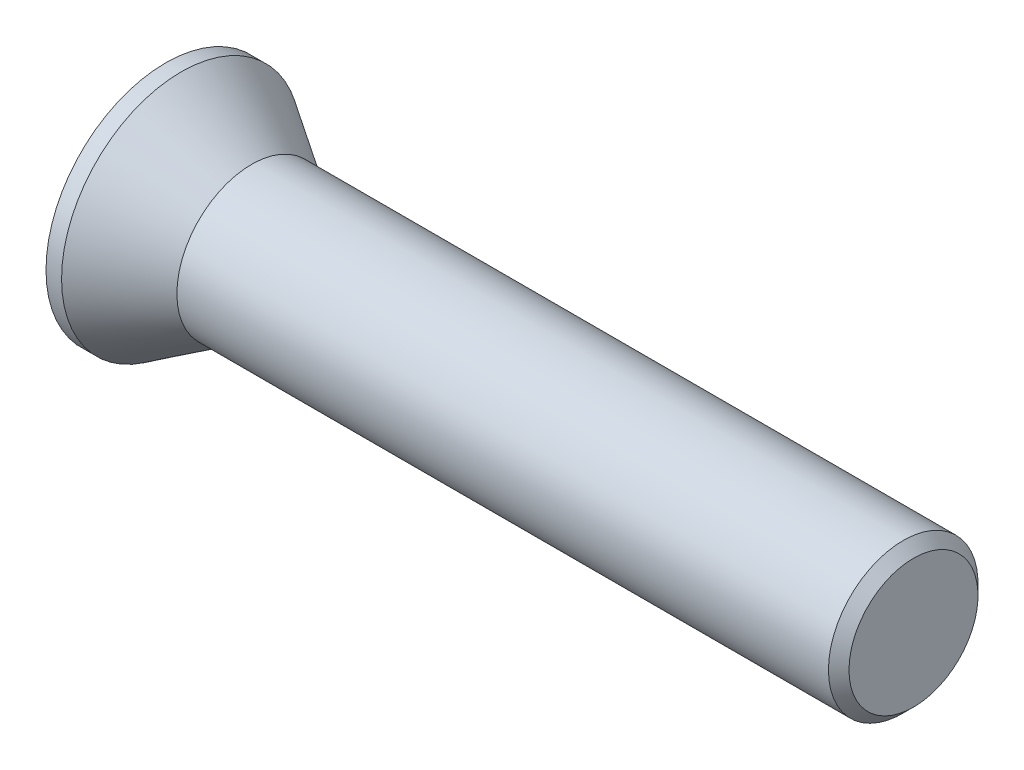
from build123d import *

# Parameters (mm, degrees)
SLOT_DEPTH      = 2.5
SLOT_DEPTH_BACK = 2.5


with BuildPart() as part:
    # BodySke → BaseBody (revolve)
    with BuildSketch(Plane.XY, mode=Mode.PRIVATE) as basebody_sk:
        Polygon((0, 0), (0, 16), (2.081886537, 16), (11.5, 10), (98.626, 10), (100, 8.626), (100, 0), align=None)
    revolve(basebody_sk.sketch.rotate(Axis((0, 0, 0), (1, 0, 0)), 90), axis=Axis((0, 0, 0), (1, 0, 0)))

    # SlotSke → Slot (cut, two sides: drawn at the far end of the back side and taken through both)
    with BuildSketch(Plane(origin=(0, 0, 0), x_dir=(1, 0, 0), z_dir=(0, 1, 0)).offset(-SLOT_DEPTH_BACK)):
        Polygon((0, 12.5), (4, 9.951718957), (4, -9.951718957), (0, -12.5), align=None)
    extrude(amount=SLOT_DEPTH + SLOT_DEPTH_BACK, mode=Mode.SUBTRACT)


solid = part.part
